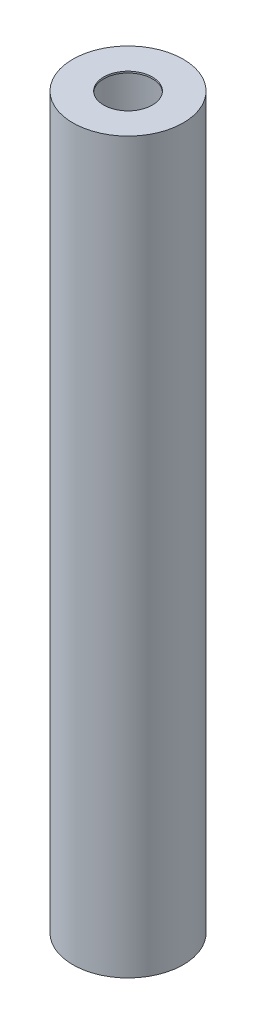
from build123d import *


with BuildPart() as part:
    # Sketch2 → Revolve1 (revolve)
    with BuildSketch(Plane.XY, mode=Mode.PRIVATE) as revolve1_sk:
        Polygon((-7.62, 0.508), (-16.764, 0.508), (-16.764, 227.584), (-7.62, 227.584), (-7.62, 228.092), (-17.272, 228.092), (-17.272, 0), (-7.62, 0), align=None)
    revolve(revolve1_sk.sketch.rotate(Axis((0, 0, 0), (0, 1, 0)), 270), axis=Axis((0, 0, 0), (0, 1, 0)))


solid = part.part
